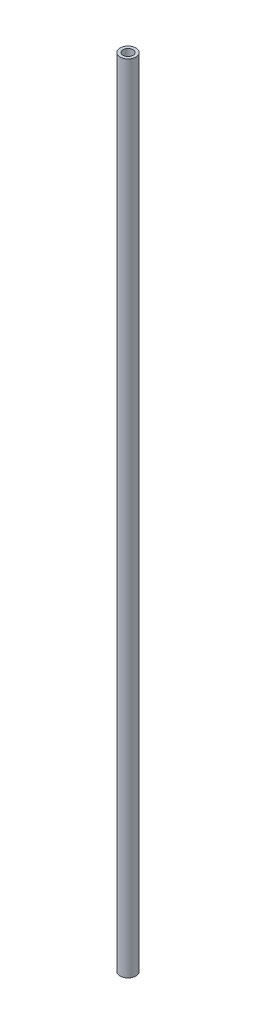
from build123d import *

# Parameters (mm, degrees)
CROQUIS1_R              = 4
SALIENTE_EXTRUIR1_DEPTH = 400
CROQUIS2_R              = 2.5
CORTAR_EXTRUIR1_DEPTH   = 5


with BuildPart() as part:
    # Croquis1 → Saliente-Extruir1 (new body)
    with BuildSketch(Plane(origin=(0, 0, 0), x_dir=(1, 0, 0), z_dir=(0, 1, 0))):
        with Locations(Location((0, 0, 0), (0, 0, 270))):
            Circle(CROQUIS1_R)
    extrude(amount=SALIENTE_EXTRUIR1_DEPTH)

    # Croquis2 → Cortar-Extruir1 (cut)
    with BuildSketch(Plane(origin=(0, 400, 0), x_dir=(1, 0, 0), z_dir=(0, 1, 0))):
        with Locations(Location((0, 0, 0), (0, 0, 270))):
            Circle(CROQUIS2_R)
    extrude(amount=-CORTAR_EXTRUIR1_DEPTH, mode=Mode.SUBTRACT)


solid = part.part
